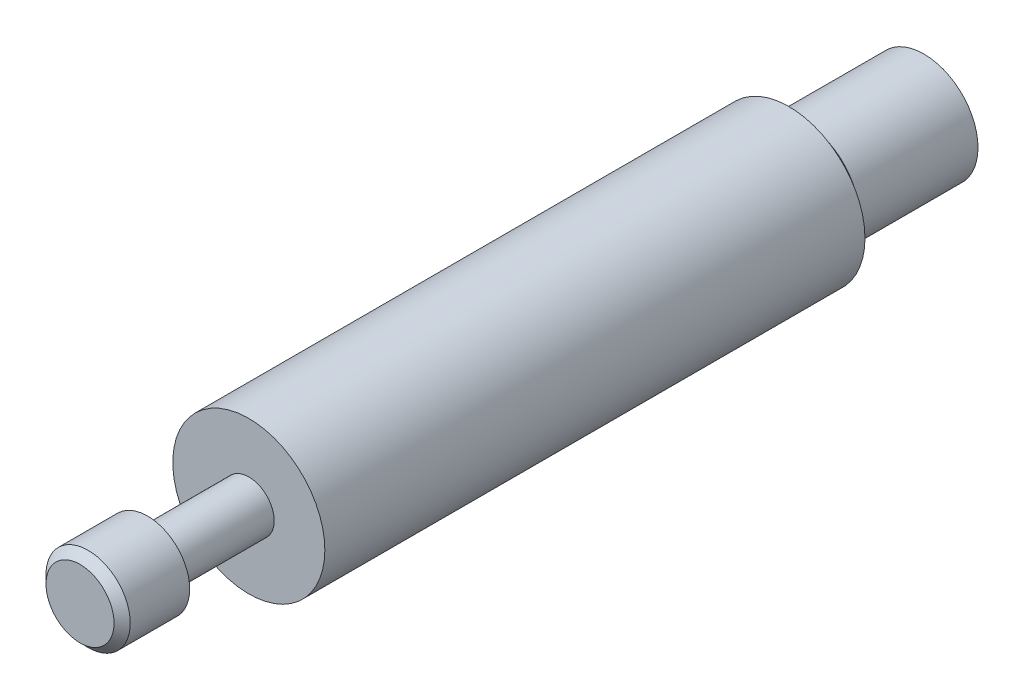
ISO-10303-21;
HEADER;
FILE_DESCRIPTION(('STEP AP214'),'2;1');
FILE_NAME('part.step','',(''),(''),'','','');
FILE_SCHEMA(('AUTOMOTIVE_DESIGN { 1 0 10303 214 1 1 1 1 }'));
ENDSEC;
DATA;
#1=APPLICATION_CONTEXT('core data for automotive mechanical design processes');
#2=APPLICATION_PROTOCOL_DEFINITION('international standard','automotive_design',2000,#1);
#3=PRODUCT_CONTEXT('',#1,'mechanical');
#4=PRODUCT('Part','Part','',(#3));
#5=PRODUCT_RELATED_PRODUCT_CATEGORY('part','',(#4));
#6=PRODUCT_DEFINITION_FORMATION('','',#4);
#7=PRODUCT_DEFINITION_CONTEXT('part definition',#1,'design');
#8=PRODUCT_DEFINITION('design','',#6,#7);
#9=PRODUCT_DEFINITION_SHAPE('','',#8);
#10=(LENGTH_UNIT() NAMED_UNIT(*) SI_UNIT(.MILLI.,.METRE.));
#11=(NAMED_UNIT(*) PLANE_ANGLE_UNIT() SI_UNIT($,.RADIAN.));
#12=(NAMED_UNIT(*) SI_UNIT($,.STERADIAN.) SOLID_ANGLE_UNIT());
#13=UNCERTAINTY_MEASURE_WITH_UNIT(LENGTH_MEASURE(1.E-05),#10,'distance_accuracy_value','');
#14=(GEOMETRIC_REPRESENTATION_CONTEXT(3) GLOBAL_UNCERTAINTY_ASSIGNED_CONTEXT((#13)) GLOBAL_UNIT_ASSIGNED_CONTEXT((#10,
#11,#12)) REPRESENTATION_CONTEXT('',''));
#15=CARTESIAN_POINT('',(0.,0.,0.));
#16=DIRECTION('',(0.,0.,1.));
#17=DIRECTION('',(1.,0.,0.));
#18=AXIS2_PLACEMENT_3D('',#15,#16,#17);
#19=CARTESIAN_POINT('',(0.,0.,25.4));
#20=DIRECTION('',(0.,0.,1.));
#21=DIRECTION('',(1.,0.,0.));
#22=AXIS2_PLACEMENT_3D('',#19,#20,#21);
#23=PLANE('',#22);
#24=CARTESIAN_POINT('',(0.,0.,25.4));
#25=DIRECTION('',(0.,0.,1.));
#26=DIRECTION('',(1.,0.,0.));
#27=AXIS2_PLACEMENT_3D('',#24,#25,#26);
#28=CIRCLE('',#27,7.1501);
#29=CARTESIAN_POINT('',(7.1501,0.,25.4));
#30=VERTEX_POINT('',#29);
#31=EDGE_CURVE('E51',#30,#30,#28,.T.);
#32=ORIENTED_EDGE('',*,*,#31,.T.);
#33=EDGE_LOOP('',(#32));
#34=FACE_BOUND('',#33,.T.);
#35=CARTESIAN_POINT('',(0.,0.,25.4));
#36=DIRECTION('',(0.,0.,1.));
#37=DIRECTION('',(1.,0.,0.));
#38=AXIS2_PLACEMENT_3D('',#35,#36,#37);
#39=CIRCLE('',#38,2.3876);
#40=CARTESIAN_POINT('',(-2.3876,0.,25.4));
#41=VERTEX_POINT('',#40);
#42=EDGE_CURVE('E61',#41,#41,#39,.T.);
#43=ORIENTED_EDGE('',*,*,#42,.F.);
#44=EDGE_LOOP('',(#43));
#45=FACE_BOUND('',#44,.T.);
#46=ADVANCED_FACE('F31',(#34,#45),#23,.T.);
#47=CARTESIAN_POINT('',(0.,0.,-25.4));
#48=DIRECTION('',(0.,0.,1.));
#49=DIRECTION('',(1.,0.,0.));
#50=AXIS2_PLACEMENT_3D('',#47,#48,#49);
#51=PLANE('',#50);
#52=CARTESIAN_POINT('',(0.,0.,-25.4));
#53=DIRECTION('',(0.,0.,1.));
#54=DIRECTION('',(1.,0.,0.));
#55=AXIS2_PLACEMENT_3D('',#52,#53,#54);
#56=CIRCLE('',#55,6.60399999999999);
#57=CARTESIAN_POINT('',(6.60399999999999,0.,-25.4));
#58=VERTEX_POINT('',#57);
#59=EDGE_CURVE('E42',#58,#58,#56,.T.);
#60=ORIENTED_EDGE('',*,*,#59,.T.);
#61=EDGE_LOOP('',(#60));
#62=FACE_BOUND('',#61,.T.);
#63=CARTESIAN_POINT('',(0.,0.,-25.4));
#64=DIRECTION('',(0.,0.,1.));
#65=DIRECTION('',(1.,0.,0.));
#66=AXIS2_PLACEMENT_3D('',#63,#64,#65);
#67=CIRCLE('',#66,7.1501);
#68=CARTESIAN_POINT('',(7.1501,0.,-25.4));
#69=VERTEX_POINT('',#68);
#70=EDGE_CURVE('E52',#69,#69,#67,.T.);
#71=ORIENTED_EDGE('',*,*,#70,.F.);
#72=EDGE_LOOP('',(#71));
#73=FACE_BOUND('',#72,.T.);
#74=ADVANCED_FACE('F86',(#62,#73),#51,.F.);
#75=CARTESIAN_POINT('',(0.,0.,25.4));
#76=DIRECTION('',(0.,0.,-1.));
#77=DIRECTION('',(-1.,0.,0.));
#78=AXIS2_PLACEMENT_3D('',#75,#76,#77);
#79=CYLINDRICAL_SURFACE('',#78,7.1501);
#80=ORIENTED_EDGE('',*,*,#31,.F.);
#81=EDGE_LOOP('',(#80));
#82=FACE_BOUND('',#81,.T.);
#83=ORIENTED_EDGE('',*,*,#70,.T.);
#84=EDGE_LOOP('',(#83));
#85=FACE_BOUND('',#84,.T.);
#86=ADVANCED_FACE('F92',(#82,#85),#79,.T.);
#87=CARTESIAN_POINT('',(0.,0.,-38.1));
#88=DIRECTION('',(0.,0.,1.));
#89=DIRECTION('',(1.,0.,0.));
#90=AXIS2_PLACEMENT_3D('',#87,#88,#89);
#91=CYLINDRICAL_SURFACE('',#90,5.08);
#92=CARTESIAN_POINT('',(0.,0.,-26.924));
#93=DIRECTION('',(0.,0.,1.));
#94=DIRECTION('',(1.,0.,0.));
#95=AXIS2_PLACEMENT_3D('',#92,#93,#94);
#96=CIRCLE('',#95,5.08);
#97=CARTESIAN_POINT('',(5.08,0.,-26.924));
#98=VERTEX_POINT('',#97);
#99=EDGE_CURVE('E46',#98,#98,#96,.F.);
#100=ORIENTED_EDGE('',*,*,#99,.T.);
#101=EDGE_LOOP('',(#100));
#102=FACE_BOUND('',#101,.T.);
#103=CARTESIAN_POINT('',(0.,0.,-38.1));
#104=DIRECTION('',(0.,0.,-1.));
#105=DIRECTION('',(-1.,0.,0.));
#106=AXIS2_PLACEMENT_3D('',#103,#104,#105);
#107=CIRCLE('',#106,5.08);
#108=CARTESIAN_POINT('',(-5.08,0.,-38.1));
#109=VERTEX_POINT('',#108);
#110=EDGE_CURVE('E55',#109,#109,#107,.T.);
#111=ORIENTED_EDGE('',*,*,#110,.F.);
#112=EDGE_LOOP('',(#111));
#113=FACE_BOUND('',#112,.T.);
#114=ADVANCED_FACE('F96',(#102,#113),#91,.T.);
#115=CARTESIAN_POINT('',(0.,0.,-38.1));
#116=DIRECTION('',(0.,0.,-1.));
#117=DIRECTION('',(-1.,0.,0.));
#118=AXIS2_PLACEMENT_3D('',#115,#116,#117);
#119=PLANE('',#118);
#120=ORIENTED_EDGE('',*,*,#110,.T.);
#121=EDGE_LOOP('',(#120));
#122=FACE_BOUND('',#121,.T.);
#123=ADVANCED_FACE('F102',(#122),#119,.T.);
#124=CARTESIAN_POINT('',(0.,0.,-26.924));
#125=DIRECTION('',(0.,0.,1.));
#126=DIRECTION('',(1.,0.,0.));
#127=AXIS2_PLACEMENT_3D('',#124,#125,#126);
#128=CONICAL_SURFACE('',#127,5.08,0.785398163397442);
#129=ORIENTED_EDGE('',*,*,#59,.F.);
#130=EDGE_LOOP('',(#129));
#131=FACE_BOUND('',#130,.T.);
#132=ORIENTED_EDGE('',*,*,#99,.F.);
#133=EDGE_LOOP('',(#132));
#134=FACE_BOUND('',#133,.T.);
#135=ADVANCED_FACE('F81',(#131,#134),#128,.T.);
#136=CARTESIAN_POINT('',(0.,0.,34.925));
#137=DIRECTION('',(0.,0.,-1.));
#138=DIRECTION('',(-1.,0.,0.));
#139=AXIS2_PLACEMENT_3D('',#136,#137,#138);
#140=CYLINDRICAL_SURFACE('',#139,2.3876);
#141=CARTESIAN_POINT('',(0.,0.,34.925));
#142=DIRECTION('',(0.,0.,1.));
#143=DIRECTION('',(1.,0.,0.));
#144=AXIS2_PLACEMENT_3D('',#141,#142,#143);
#145=CIRCLE('',#144,2.3876);
#146=CARTESIAN_POINT('',(-2.3876,0.,34.925));
#147=VERTEX_POINT('',#146);
#148=EDGE_CURVE('E60',#147,#147,#145,.T.);
#149=CARTESIAN_POINT('',(-2.3876,0.,34.925));
#150=CARTESIAN_POINT('',(-2.3876,0.,34.82578125));
#151=CARTESIAN_POINT('',(-2.3876,0.,34.7265625));
#152=CARTESIAN_POINT('',(-2.3876,0.,34.528125));
#153=CARTESIAN_POINT('',(-2.3876,0.,34.42890625));
#154=CARTESIAN_POINT('',(-2.3876,0.,34.23046875));
#155=CARTESIAN_POINT('',(-2.3876,0.,34.13125));
#156=CARTESIAN_POINT('',(-2.3876,0.,33.9328125));
#157=CARTESIAN_POINT('',(-2.3876,0.,33.83359375));
#158=CARTESIAN_POINT('',(-2.3876,0.,33.63515625));
#159=CARTESIAN_POINT('',(-2.3876,0.,33.5359375));
#160=CARTESIAN_POINT('',(-2.3876,0.,33.3375));
#161=CARTESIAN_POINT('',(-2.3876,0.,33.23828125));
#162=CARTESIAN_POINT('',(-2.3876,0.,33.03984375));
#163=CARTESIAN_POINT('',(-2.3876,0.,32.940625));
#164=CARTESIAN_POINT('',(-2.3876,0.,32.7421875));
#165=CARTESIAN_POINT('',(-2.3876,0.,32.64296875));
#166=CARTESIAN_POINT('',(-2.3876,0.,32.44453125));
#167=CARTESIAN_POINT('',(-2.3876,0.,32.3453125));
#168=CARTESIAN_POINT('',(-2.3876,0.,32.146875));
#169=CARTESIAN_POINT('',(-2.3876,0.,32.04765625));
#170=CARTESIAN_POINT('',(-2.3876,0.,31.84921875));
#171=CARTESIAN_POINT('',(-2.3876,0.,31.75));
#172=CARTESIAN_POINT('',(-2.3876,0.,31.5515625));
#173=CARTESIAN_POINT('',(-2.3876,0.,31.45234375));
#174=CARTESIAN_POINT('',(-2.3876,0.,31.25390625));
#175=CARTESIAN_POINT('',(-2.3876,0.,31.1546875));
#176=CARTESIAN_POINT('',(-2.3876,0.,30.95625));
#177=CARTESIAN_POINT('',(-2.3876,0.,30.85703125));
#178=CARTESIAN_POINT('',(-2.3876,0.,30.65859375));
#179=CARTESIAN_POINT('',(-2.3876,0.,30.559375));
#180=CARTESIAN_POINT('',(-2.3876,0.,30.3609375));
#181=CARTESIAN_POINT('',(-2.3876,0.,30.26171875));
#182=CARTESIAN_POINT('',(-2.3876,0.,30.06328125));
#183=CARTESIAN_POINT('',(-2.3876,0.,29.9640625));
#184=CARTESIAN_POINT('',(-2.3876,0.,29.765625));
#185=CARTESIAN_POINT('',(-2.3876,0.,29.66640625));
#186=CARTESIAN_POINT('',(-2.3876,0.,29.46796875));
#187=CARTESIAN_POINT('',(-2.3876,0.,29.36875));
#188=CARTESIAN_POINT('',(-2.3876,0.,29.1703125));
#189=CARTESIAN_POINT('',(-2.3876,0.,29.07109375));
#190=CARTESIAN_POINT('',(-2.3876,0.,28.87265625));
#191=CARTESIAN_POINT('',(-2.3876,0.,28.7734375));
#192=CARTESIAN_POINT('',(-2.3876,0.,28.575));
#193=CARTESIAN_POINT('',(-2.3876,0.,28.47578125));
#194=CARTESIAN_POINT('',(-2.3876,0.,28.27734375));
#195=CARTESIAN_POINT('',(-2.3876,0.,28.178125));
#196=CARTESIAN_POINT('',(-2.3876,0.,27.9796875));
#197=CARTESIAN_POINT('',(-2.3876,0.,27.88046875));
#198=CARTESIAN_POINT('',(-2.3876,0.,27.68203125));
#199=CARTESIAN_POINT('',(-2.3876,0.,27.5828125));
#200=CARTESIAN_POINT('',(-2.3876,0.,27.384375));
#201=CARTESIAN_POINT('',(-2.3876,0.,27.28515625));
#202=CARTESIAN_POINT('',(-2.3876,0.,27.08671875));
#203=CARTESIAN_POINT('',(-2.3876,0.,26.9875));
#204=CARTESIAN_POINT('',(-2.3876,0.,26.7890625));
#205=CARTESIAN_POINT('',(-2.3876,0.,26.68984375));
#206=CARTESIAN_POINT('',(-2.3876,0.,26.49140625));
#207=CARTESIAN_POINT('',(-2.3876,0.,26.3921875));
#208=CARTESIAN_POINT('',(-2.3876,0.,26.19375));
#209=CARTESIAN_POINT('',(-2.3876,0.,26.09453125));
#210=CARTESIAN_POINT('',(-2.3876,0.,25.89609375));
#211=CARTESIAN_POINT('',(-2.3876,0.,25.796875));
#212=CARTESIAN_POINT('',(-2.3876,0.,25.5984375));
#213=CARTESIAN_POINT('',(-2.3876,0.,25.49921875));
#214=CARTESIAN_POINT('',(-2.3876,0.,25.4));
#215=B_SPLINE_CURVE_WITH_KNOTS('',3,(#149,#150,#151,#152,#153,#154,#155,#156,#157,#158,#159,
#160,#161,#162,#163,#164,#165,#166,#167,#168,#169,#170,#171,#172,#173,#174,#175,#176,#177,#178,
#179,#180,#181,#182,#183,#184,#185,#186,#187,#188,#189,#190,#191,#192,#193,#194,#195,#196,#197,
#198,#199,#200,#201,#202,#203,#204,#205,#206,#207,#208,#209,#210,#211,#212,#213,#214),
.UNSPECIFIED.,.F.,.F.,(4,2,2,2,2,2,2,2,2,2,2,2,2,2,2,2,2,2,2,2,2,2,2,2,2,2,2,2,2,2,2,2,4),(0.,
0.297656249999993,0.595312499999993,0.892968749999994,1.19062499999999,1.48828124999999,
1.78593749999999,2.08359374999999,2.38124999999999,2.67890624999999,2.97656249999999,
3.27421874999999,3.571875,3.86953125,4.1671875,4.46484375,4.7625,5.06015625,5.3578125,
5.65546875,5.953125,6.25078125,6.54843749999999,6.84609374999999,7.14374999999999,
7.44140624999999,7.73906249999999,8.03671875,8.33437499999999,8.63203124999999,8.92968749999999,
9.22734374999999,9.52499999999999),.UNSPECIFIED.);
#216=EDGE_CURVE('BSEAM75',#147,#41,#215,.T.);
#217=ORIENTED_EDGE('',*,*,#148,.F.);
#218=ORIENTED_EDGE('',*,*,#42,.T.);
#219=ORIENTED_EDGE('',*,*,#216,.T.);
#220=ORIENTED_EDGE('',*,*,#216,.F.);
#221=EDGE_LOOP('',(#217,#219,#218,#220));
#222=FACE_BOUND('',#221,.T.);
#223=ADVANCED_FACE('F75',(#222),#140,.T.);
#224=CARTESIAN_POINT('',(0.,0.,34.925));
#225=DIRECTION('',(0.,0.,1.));
#226=DIRECTION('',(1.,0.,0.));
#227=AXIS2_PLACEMENT_3D('',#224,#225,#226);
#228=PLANE('',#227);
#229=CARTESIAN_POINT('',(0.,0.,34.925));
#230=DIRECTION('',(0.,0.,1.));
#231=DIRECTION('',(1.,0.,0.));
#232=AXIS2_PLACEMENT_3D('',#229,#230,#231);
#233=CIRCLE('',#232,3.9624);
#234=CARTESIAN_POINT('',(3.9624,0.,34.925));
#235=VERTEX_POINT('',#234);
#236=EDGE_CURVE('E64',#235,#235,#233,.T.);
#237=ORIENTED_EDGE('',*,*,#236,.F.);
#238=EDGE_LOOP('',(#237));
#239=FACE_BOUND('',#238,.T.);
#240=ORIENTED_EDGE('',*,*,#148,.T.);
#241=EDGE_LOOP('',(#240));
#242=FACE_BOUND('',#241,.T.);
#243=ADVANCED_FACE('F72',(#239,#242),#228,.F.);
#244=CARTESIAN_POINT('',(0.,0.,41.275));
#245=DIRECTION('',(0.,0.,-1.));
#246=DIRECTION('',(-1.,0.,0.));
#247=AXIS2_PLACEMENT_3D('',#244,#245,#246);
#248=CYLINDRICAL_SURFACE('',#247,3.9624);
#249=CARTESIAN_POINT('',(0.,0.,40.513));
#250=DIRECTION('',(0.,0.,1.));
#251=DIRECTION('',(1.,0.,0.));
#252=AXIS2_PLACEMENT_3D('',#249,#250,#251);
#253=CIRCLE('',#252,3.9624);
#254=CARTESIAN_POINT('',(3.9624,0.,40.513));
#255=VERTEX_POINT('',#254);
#256=EDGE_CURVE('E10',#255,#255,#253,.F.);
#257=ORIENTED_EDGE('',*,*,#256,.T.);
#258=EDGE_LOOP('',(#257));
#259=FACE_BOUND('',#258,.T.);
#260=ORIENTED_EDGE('',*,*,#236,.T.);
#261=EDGE_LOOP('',(#260));
#262=FACE_BOUND('',#261,.T.);
#263=ADVANCED_FACE('F70',(#259,#262),#248,.T.);
#264=CARTESIAN_POINT('',(0.,0.,41.275));
#265=DIRECTION('',(0.,0.,1.));
#266=DIRECTION('',(1.,0.,0.));
#267=AXIS2_PLACEMENT_3D('',#264,#265,#266);
#268=PLANE('',#267);
#269=CARTESIAN_POINT('',(0.,0.,41.275));
#270=DIRECTION('',(0.,0.,1.));
#271=DIRECTION('',(1.,0.,0.));
#272=AXIS2_PLACEMENT_3D('',#269,#270,#271);
#273=CIRCLE('',#272,3.2004);
#274=CARTESIAN_POINT('',(3.2004,0.,41.275));
#275=VERTEX_POINT('',#274);
#276=EDGE_CURVE('E38',#275,#275,#273,.T.);
#277=ORIENTED_EDGE('',*,*,#276,.T.);
#278=EDGE_LOOP('',(#277));
#279=FACE_BOUND('',#278,.T.);
#280=ADVANCED_FACE('F163',(#279),#268,.T.);
#281=CARTESIAN_POINT('',(0.,0.,41.275));
#282=DIRECTION('',(0.,0.,-1.));
#283=DIRECTION('',(-1.,0.,0.));
#284=AXIS2_PLACEMENT_3D('',#281,#282,#283);
#285=CONICAL_SURFACE('',#284,3.2004,0.785398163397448);
#286=ORIENTED_EDGE('',*,*,#256,.F.);
#287=EDGE_LOOP('',(#286));
#288=FACE_BOUND('',#287,.T.);
#289=ORIENTED_EDGE('',*,*,#276,.F.);
#290=EDGE_LOOP('',(#289));
#291=FACE_BOUND('',#290,.T.);
#292=ADVANCED_FACE('F33',(#288,#291),#285,.T.);
#293=CLOSED_SHELL('',(#46,#74,#86,#114,#123,#135,#223,#243,#263,#280,#292));
#294=MANIFOLD_SOLID_BREP('B2',#293);
#295=ADVANCED_BREP_SHAPE_REPRESENTATION('',(#18,#294),#14);
#296=SHAPE_DEFINITION_REPRESENTATION(#9,#295);
ENDSEC;
END-ISO-10303-21;
